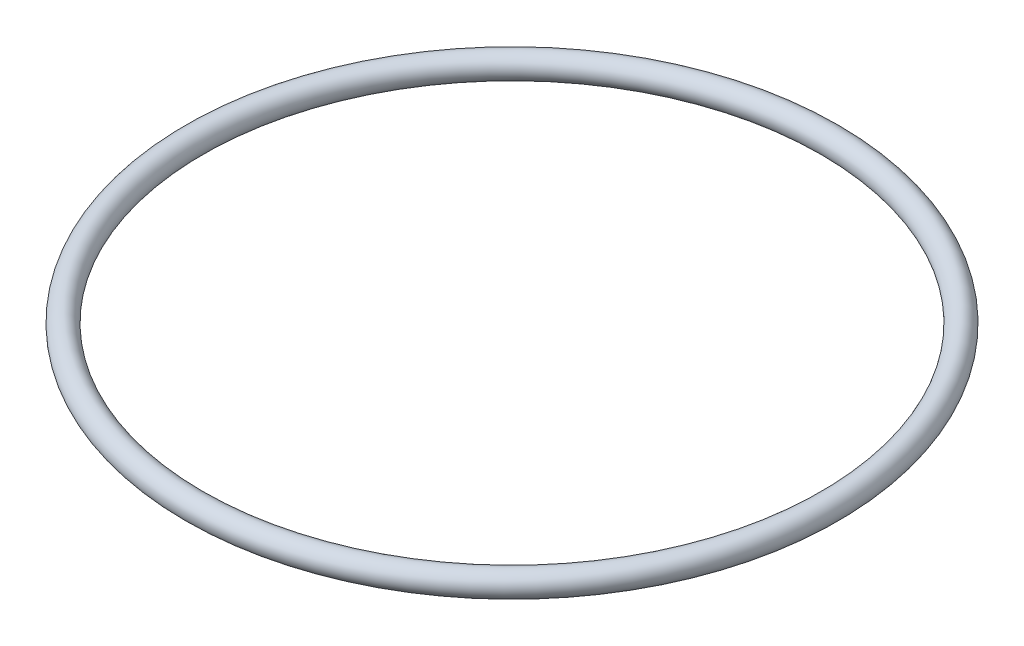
ISO-10303-21;
HEADER;
FILE_DESCRIPTION(('STEP AP214'),'2;1');
FILE_NAME('part.step','',(''),(''),'','','');
FILE_SCHEMA(('AUTOMOTIVE_DESIGN { 1 0 10303 214 1 1 1 1 }'));
ENDSEC;
DATA;
#1=APPLICATION_CONTEXT('core data for automotive mechanical design processes');
#2=APPLICATION_PROTOCOL_DEFINITION('international standard','automotive_design',2000,#1);
#3=PRODUCT_CONTEXT('',#1,'mechanical');
#4=PRODUCT('Part','Part','',(#3));
#5=PRODUCT_RELATED_PRODUCT_CATEGORY('part','',(#4));
#6=PRODUCT_DEFINITION_FORMATION('','',#4);
#7=PRODUCT_DEFINITION_CONTEXT('part definition',#1,'design');
#8=PRODUCT_DEFINITION('design','',#6,#7);
#9=PRODUCT_DEFINITION_SHAPE('','',#8);
#10=(LENGTH_UNIT() NAMED_UNIT(*) SI_UNIT(.MILLI.,.METRE.));
#11=(NAMED_UNIT(*) PLANE_ANGLE_UNIT() SI_UNIT($,.RADIAN.));
#12=(NAMED_UNIT(*) SI_UNIT($,.STERADIAN.) SOLID_ANGLE_UNIT());
#13=UNCERTAINTY_MEASURE_WITH_UNIT(LENGTH_MEASURE(1.E-05),#10,'distance_accuracy_value','');
#14=(GEOMETRIC_REPRESENTATION_CONTEXT(3) GLOBAL_UNCERTAINTY_ASSIGNED_CONTEXT((#13)) GLOBAL_UNIT_ASSIGNED_CONTEXT((#10,
#11,#12)) REPRESENTATION_CONTEXT('',''));
#15=CARTESIAN_POINT('',(0.,0.,0.));
#16=DIRECTION('',(0.,0.,1.));
#17=DIRECTION('',(1.,0.,0.));
#18=AXIS2_PLACEMENT_3D('',#15,#16,#17);
#19=CARTESIAN_POINT('',(0.,0.,0.));
#20=DIRECTION('',(0.,-1.,0.));
#21=DIRECTION('',(0.,0.,-1.));
#22=AXIS2_PLACEMENT_3D('',#19,#20,#21);
#23=TOROIDAL_SURFACE('',#22,34.4805,1.3081);
#24=CARTESIAN_POINT('',(0.,0.,-35.7886));
#25=VERTEX_POINT('',#24);
#26=VERTEX_LOOP('',#25);
#27=FACE_BOUND('',#26,.T.);
#28=ADVANCED_FACE('F31',(#27),#23,.T.);
#29=CLOSED_SHELL('',(#28));
#30=MANIFOLD_SOLID_BREP('B2',#29);
#31=ADVANCED_BREP_SHAPE_REPRESENTATION('',(#18,#30),#14);
#32=SHAPE_DEFINITION_REPRESENTATION(#9,#31);
ENDSEC;
END-ISO-10303-21;
